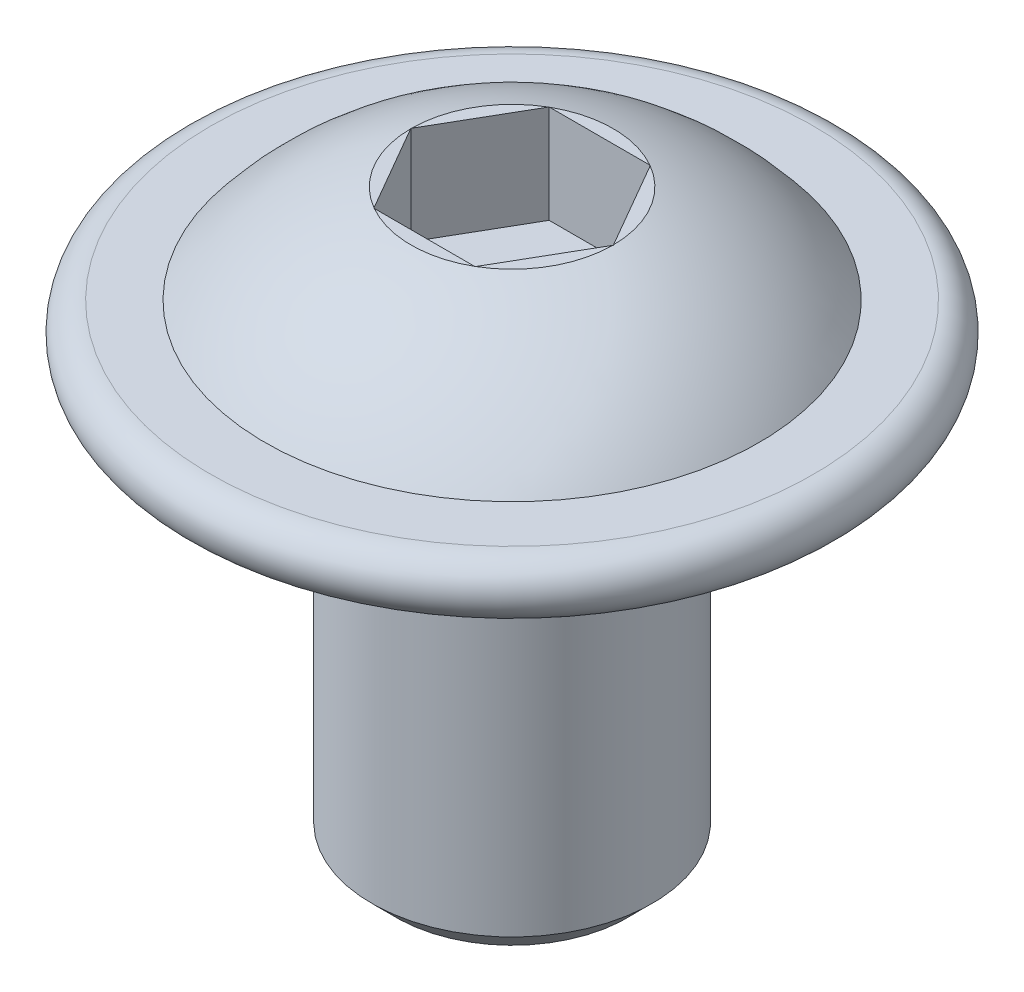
from build123d import *

# Parameters (mm, degrees)
ENL_V_MAT_EXTRU_1_DEPTH = 1.4


with BuildPart() as part:
    # Esquisse1 → R_volution1 (revolve)
    with BuildSketch(Plane.XY, mode=Mode.PRIVATE) as r_volution1_sk:
        with BuildLine():
            Line((0, 2.2), (1.44, 2.2))
            ThreePointArc((1.44, 2.2), (2.589643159, 1.662898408), (3.52, 0.8))
            Line((3.52, 0.8), (4.3, 0.8))
            ThreePointArc((4.3, 0.8), (4.7, 0.4), (4.3, 0))
            Line((4.3, 0), (2.2, 0))
            ThreePointArc((2.2, 0), (2.058578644, -0.058578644), (2, -0.2))
            Line((2, -0.2), (2, -5.65))
            Line((2, -5.65), (1.65, -6))
            Line((1.65, -6), (0, -6))
            Line((0, -6), (0, 2.2))
        make_face()
    revolve(r_volution1_sk.sketch.rotate(Axis((0, 2.2, 0), (0, -1, 0)), 180), axis=Axis((0, 2.2, 0), (0, -1, 0)))

    # Esquisse2 → Enl_v. mat.-Extru.1 (cut)
    with BuildSketch(Plane(origin=(0, 2.2, 0), x_dir=(1, 0, 0), z_dir=(0, 1, 0))):
        Polygon((1.443375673, 0), (0.721687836, 1.25), (-0.721687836, 1.25), (-1.443375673, 0), (-0.721687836, -1.25), (0.721687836, -1.25), align=None)
    extrude(amount=-ENL_V_MAT_EXTRU_1_DEPTH, mode=Mode.SUBTRACT)


solid = part.part
